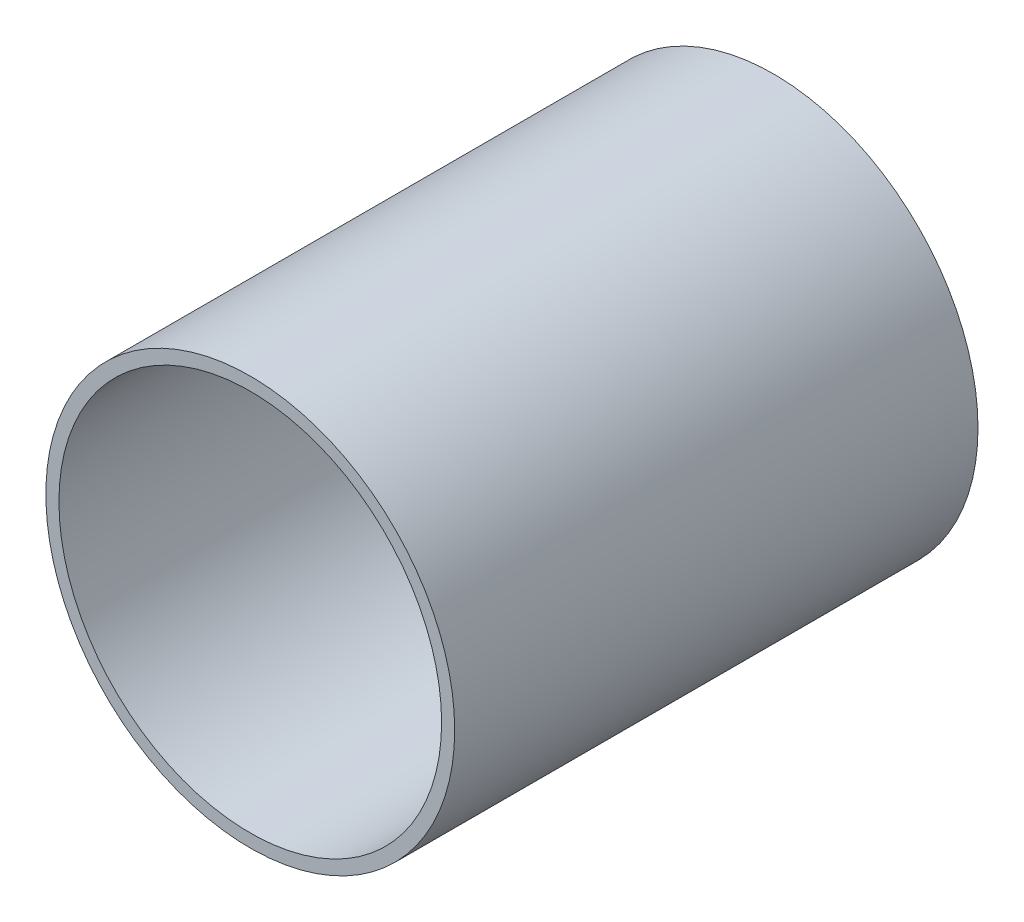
from build123d import *

# Parameters (mm, degrees)
ESQUISSE1_R        = 62.5
ESQUISSE1_R_2      = 58.5
BOSS_EXTRU_1_DEPTH = 160


with BuildPart() as part:
    # Esquisse1 → Boss.-Extru.1 (new body)
    with BuildSketch(Plane.XY):
        Circle(ESQUISSE1_R)
        Circle(ESQUISSE1_R_2, mode=Mode.SUBTRACT)
    extrude(amount=BOSS_EXTRU_1_DEPTH)


solid = part.part
